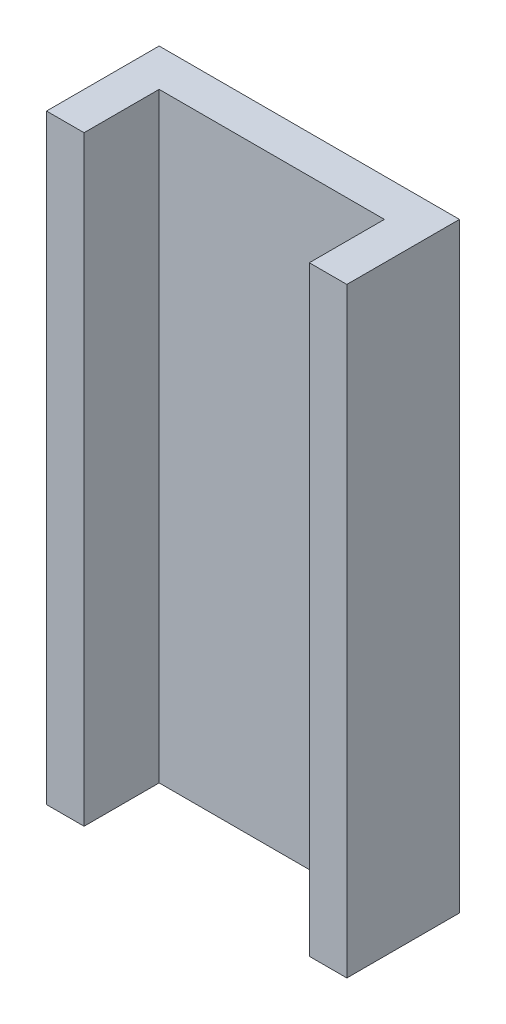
from build123d import *

# Parameters (mm, degrees)
BOSS_EXTRUDE1_DEPTH = 101.6


with BuildPart() as part:
    # Sketch1 → Boss-Extrude1 (new body)
    with BuildSketch(Plane(origin=(0, 0, 0), x_dir=(1, 0, 0), z_dir=(0, 1, 0))):
        Polygon((-19.05, 0), (19.05, 0), (19.05, -12.7), (25.4, -12.7), (25.4, 6.35), (-25.4, 6.35), (-25.4, -12.7), (-19.05, -12.7), align=None)
    extrude(amount=BOSS_EXTRUDE1_DEPTH)


solid = part.part
